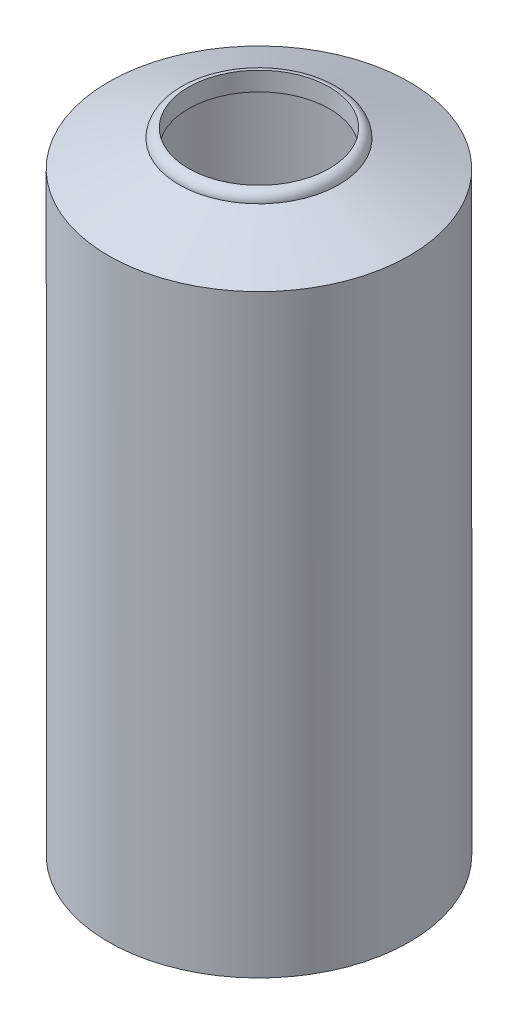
ISO-10303-21;
HEADER;
FILE_DESCRIPTION(('STEP AP214'),'2;1');
FILE_NAME('part.step','',(''),(''),'','','');
FILE_SCHEMA(('AUTOMOTIVE_DESIGN { 1 0 10303 214 1 1 1 1 }'));
ENDSEC;
DATA;
#1=APPLICATION_CONTEXT('core data for automotive mechanical design processes');
#2=APPLICATION_PROTOCOL_DEFINITION('international standard','automotive_design',2000,#1);
#3=PRODUCT_CONTEXT('',#1,'mechanical');
#4=PRODUCT('Part','Part','',(#3));
#5=PRODUCT_RELATED_PRODUCT_CATEGORY('part','',(#4));
#6=PRODUCT_DEFINITION_FORMATION('','',#4);
#7=PRODUCT_DEFINITION_CONTEXT('part definition',#1,'design');
#8=PRODUCT_DEFINITION('design','',#6,#7);
#9=PRODUCT_DEFINITION_SHAPE('','',#8);
#10=(LENGTH_UNIT() NAMED_UNIT(*) SI_UNIT(.MILLI.,.METRE.));
#11=(NAMED_UNIT(*) PLANE_ANGLE_UNIT() SI_UNIT($,.RADIAN.));
#12=(NAMED_UNIT(*) SI_UNIT($,.STERADIAN.) SOLID_ANGLE_UNIT());
#13=UNCERTAINTY_MEASURE_WITH_UNIT(LENGTH_MEASURE(1.E-05),#10,'distance_accuracy_value','');
#14=(GEOMETRIC_REPRESENTATION_CONTEXT(3) GLOBAL_UNCERTAINTY_ASSIGNED_CONTEXT((#13)) GLOBAL_UNIT_ASSIGNED_CONTEXT((#10,
#11,#12)) REPRESENTATION_CONTEXT('',''));
#15=CARTESIAN_POINT('',(0.,0.,0.));
#16=DIRECTION('',(0.,0.,1.));
#17=DIRECTION('',(1.,0.,0.));
#18=AXIS2_PLACEMENT_3D('',#15,#16,#17);
#19=CARTESIAN_POINT('',(406.4,-33.6753390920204,0.));
#20=DIRECTION('',(0.,-1.,0.));
#21=DIRECTION('',(1.,0.,0.));
#22=AXIS2_PLACEMENT_3D('',#19,#20,#21);
#23=CYLINDRICAL_SURFACE('',#22,381.);
#24=CARTESIAN_POINT('',(406.4,1562.21474765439,0.));
#25=DIRECTION('',(0.,-1.,0.));
#26=DIRECTION('',(1.,0.,0.));
#27=AXIS2_PLACEMENT_3D('',#24,#25,#26);
#28=CIRCLE('',#27,381.);
#29=CARTESIAN_POINT('',(787.4,1562.21474765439,0.));
#30=VERTEX_POINT('',#29);
#31=EDGE_CURVE('E10',#30,#30,#28,.T.);
#32=ORIENTED_EDGE('',*,*,#31,.F.);
#33=EDGE_LOOP('',(#32));
#34=FACE_BOUND('',#33,.T.);
#35=CARTESIAN_POINT('',(406.4,0.,0.));
#36=DIRECTION('',(0.,-1.,0.));
#37=DIRECTION('',(1.,0.,0.));
#38=AXIS2_PLACEMENT_3D('',#35,#36,#37);
#39=CIRCLE('',#38,381.);
#40=CARTESIAN_POINT('',(787.4,0.,0.));
#41=VERTEX_POINT('',#40);
#42=EDGE_CURVE('E34',#41,#41,#39,.T.);
#43=ORIENTED_EDGE('',*,*,#42,.T.);
#44=EDGE_LOOP('',(#43));
#45=FACE_BOUND('',#44,.T.);
#46=ADVANCED_FACE('F31',(#34,#45),#23,.F.);
#47=CARTESIAN_POINT('',(406.4,1562.21474765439,0.));
#48=DIRECTION('',(0.,-1.,0.));
#49=DIRECTION('',(1.,0.,0.));
#50=AXIS2_PLACEMENT_3D('',#47,#48,#49);
#51=CONICAL_SURFACE('',#50,381.,1.21537512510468);
#52=CARTESIAN_POINT('',(406.4,1625.19060740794,0.));
#53=DIRECTION('',(0.,-1.,0.));
#54=DIRECTION('',(1.,0.,0.));
#55=AXIS2_PLACEMENT_3D('',#52,#53,#54);
#56=CIRCLE('',#55,211.33802532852);
#57=CARTESIAN_POINT('',(617.73802532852,1625.19060740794,0.));
#58=VERTEX_POINT('',#57);
#59=EDGE_CURVE('E38',#58,#58,#56,.T.);
#60=ORIENTED_EDGE('',*,*,#59,.F.);
#61=EDGE_LOOP('',(#60));
#62=FACE_BOUND('',#61,.T.);
#63=ORIENTED_EDGE('',*,*,#31,.T.);
#64=EDGE_LOOP('',(#63));
#65=FACE_BOUND('',#64,.T.);
#66=ADVANCED_FACE('F78',(#62,#65),#51,.F.);
#67=CARTESIAN_POINT('',(195.06197467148,1625.19060740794,0.));
#68=DIRECTION('',(0.,1.,0.));
#69=DIRECTION('',(-1.,0.,0.));
#70=AXIS2_PLACEMENT_3D('',#67,#68,#69);
#71=PLANE('',#70);
#72=CARTESIAN_POINT('',(406.4,1625.19060740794,0.));
#73=DIRECTION('',(0.,1.,0.));
#74=DIRECTION('',(-1.,0.,0.));
#75=AXIS2_PLACEMENT_3D('',#72,#73,#74);
#76=CIRCLE('',#75,190.5);
#77=CARTESIAN_POINT('',(215.9,1625.19060740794,0.));
#78=VERTEX_POINT('',#77);
#79=EDGE_CURVE('E50',#78,#78,#76,.T.);
#80=ORIENTED_EDGE('',*,*,#79,.T.);
#81=EDGE_LOOP('',(#80));
#82=FACE_BOUND('',#81,.T.);
#83=ORIENTED_EDGE('',*,*,#59,.T.);
#84=EDGE_LOOP('',(#83));
#85=FACE_BOUND('',#84,.T.);
#86=ADVANCED_FACE('F83',(#82,#85),#71,.F.);
#87=CARTESIAN_POINT('',(406.4,1650.59060740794,0.));
#88=DIRECTION('',(0.,-1.,0.));
#89=DIRECTION('',(1.,0.,0.));
#90=AXIS2_PLACEMENT_3D('',#87,#88,#89);
#91=TOROIDAL_SURFACE('',#90,190.5,25.4);
#92=CARTESIAN_POINT('',(406.4,1650.59060740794,0.));
#93=DIRECTION('',(0.,-1.,0.));
#94=DIRECTION('',(1.,0.,0.));
#95=AXIS2_PLACEMENT_3D('',#92,#93,#94);
#96=CIRCLE('',#95,215.9);
#97=CARTESIAN_POINT('',(622.3,1650.59060740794,0.));
#98=VERTEX_POINT('',#97);
#99=EDGE_CURVE('E42',#98,#98,#96,.T.);
#100=ORIENTED_EDGE('',*,*,#99,.F.);
#101=EDGE_LOOP('',(#100));
#102=FACE_BOUND('',#101,.T.);
#103=CARTESIAN_POINT('',(406.4,1675.99060740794,0.));
#104=DIRECTION('',(0.,1.,0.));
#105=DIRECTION('',(-1.,0.,0.));
#106=AXIS2_PLACEMENT_3D('',#103,#104,#105);
#107=CIRCLE('',#106,190.5);
#108=CARTESIAN_POINT('',(215.9,1675.99060740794,0.));
#109=VERTEX_POINT('',#108);
#110=EDGE_CURVE('E53',#109,#109,#107,.T.);
#111=ORIENTED_EDGE('',*,*,#110,.F.);
#112=EDGE_LOOP('',(#111));
#113=FACE_BOUND('',#112,.T.);
#114=ADVANCED_FACE('F88',(#102,#113),#91,.T.);
#115=CARTESIAN_POINT('',(406.4,1650.59060740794,0.));
#116=DIRECTION('',(0.,-1.,0.));
#117=DIRECTION('',(1.,0.,0.));
#118=AXIS2_PLACEMENT_3D('',#115,#116,#117);
#119=CONICAL_SURFACE('',#118,215.9,1.21537512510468);
#120=CARTESIAN_POINT('',(406.4,1579.88,0.));
#121=DIRECTION('',(0.,-1.,0.));
#122=DIRECTION('',(1.,0.,0.));
#123=AXIS2_PLACEMENT_3D('',#120,#121,#122);
#124=CIRCLE('',#123,406.4);
#125=CARTESIAN_POINT('',(812.8,1579.88,0.));
#126=VERTEX_POINT('',#125);
#127=EDGE_CURVE('E47',#126,#126,#124,.T.);
#128=ORIENTED_EDGE('',*,*,#127,.F.);
#129=EDGE_LOOP('',(#128));
#130=FACE_BOUND('',#129,.T.);
#131=ORIENTED_EDGE('',*,*,#99,.T.);
#132=EDGE_LOOP('',(#131));
#133=FACE_BOUND('',#132,.T.);
#134=ADVANCED_FACE('F95',(#130,#133),#119,.T.);
#135=CARTESIAN_POINT('',(406.4,-33.6753390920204,0.));
#136=DIRECTION('',(0.,-1.,0.));
#137=DIRECTION('',(1.,0.,0.));
#138=AXIS2_PLACEMENT_3D('',#135,#136,#137);
#139=CYLINDRICAL_SURFACE('',#138,406.4);
#140=ORIENTED_EDGE('',*,*,#127,.T.);
#141=EDGE_LOOP('',(#140));
#142=FACE_BOUND('',#141,.T.);
#143=CARTESIAN_POINT('',(406.4,-25.4,0.));
#144=DIRECTION('',(0.,-1.,0.));
#145=DIRECTION('',(0.,0.,-1.));
#146=AXIS2_PLACEMENT_3D('',#143,#144,#145);
#147=CIRCLE('',#146,406.4);
#148=CARTESIAN_POINT('',(406.4,-25.4,-406.4));
#149=VERTEX_POINT('',#148);
#150=EDGE_CURVE('E56',#149,#149,#147,.T.);
#151=ORIENTED_EDGE('',*,*,#150,.F.);
#152=EDGE_LOOP('',(#151));
#153=FACE_BOUND('',#152,.T.);
#154=ADVANCED_FACE('F74',(#142,#153),#139,.T.);
#155=CARTESIAN_POINT('',(406.4,1548.99060740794,0.));
#156=DIRECTION('',(0.,1.,0.));
#157=DIRECTION('',(-1.,0.,0.));
#158=AXIS2_PLACEMENT_3D('',#155,#156,#157);
#159=CYLINDRICAL_SURFACE('',#158,190.5);
#160=ORIENTED_EDGE('',*,*,#110,.T.);
#161=EDGE_LOOP('',(#160));
#162=FACE_BOUND('',#161,.T.);
#163=ORIENTED_EDGE('',*,*,#79,.F.);
#164=EDGE_LOOP('',(#163));
#165=FACE_BOUND('',#164,.T.);
#166=ADVANCED_FACE('F67',(#162,#165),#159,.F.);
#167=CARTESIAN_POINT('',(406.4,0.,0.));
#168=DIRECTION('',(0.,-1.,0.));
#169=DIRECTION('',(0.,0.,-1.));
#170=AXIS2_PLACEMENT_3D('',#167,#168,#169);
#171=PLANE('',#170);
#172=ORIENTED_EDGE('',*,*,#42,.F.);
#173=EDGE_LOOP('',(#172));
#174=FACE_BOUND('',#173,.T.);
#175=ADVANCED_FACE('F64',(#174),#171,.F.);
#176=CARTESIAN_POINT('',(406.4,-25.4,0.));
#177=DIRECTION('',(0.,-1.,0.));
#178=DIRECTION('',(0.,0.,-1.));
#179=AXIS2_PLACEMENT_3D('',#176,#177,#178);
#180=PLANE('',#179);
#181=ORIENTED_EDGE('',*,*,#150,.T.);
#182=EDGE_LOOP('',(#181));
#183=FACE_BOUND('',#182,.T.);
#184=ADVANCED_FACE('F66',(#183),#180,.T.);
#185=CLOSED_SHELL('',(#46,#66,#86,#114,#134,#154,#166,#175,#184));
#186=MANIFOLD_SOLID_BREP('B2',#185);
#187=ADVANCED_BREP_SHAPE_REPRESENTATION('',(#18,#186),#14);
#188=SHAPE_DEFINITION_REPRESENTATION(#9,#187);
ENDSEC;
END-ISO-10303-21;
